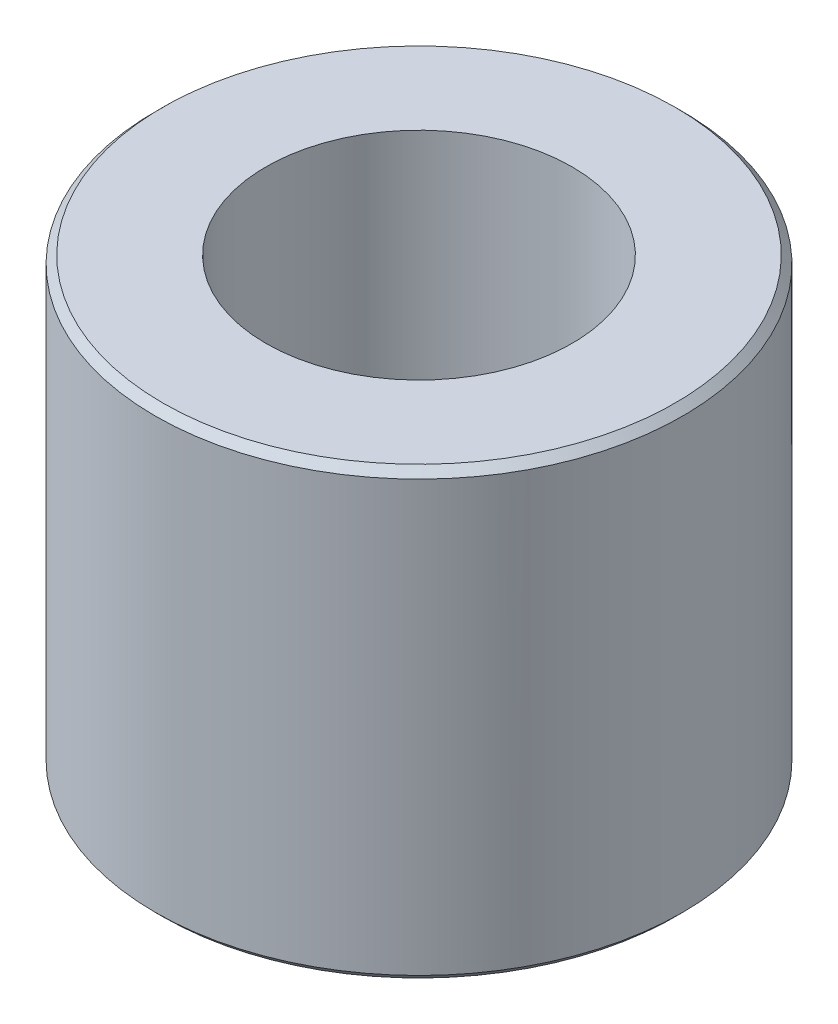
from build123d import *

# Parameters (mm, degrees)
SKETCH1_W                   = 17.78
SKETCH1_H                   = 29.9974
F_7_8_20_TAPPED_HOLE1_D     = 20.6375
F_7_8_20_TAPPED_HOLE1_DEPTH = 53.5178
F_7_8_20_TAPPED_HOLE1_TIP   = 6.200130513
CHAMFER1_SIZE               = 1.651
CUT_EXTRUDE1_DEPTH          = 12.7
CHAMFER2_SIZE               = 0.508


with BuildPart() as part:
    # Sketch1 → Revolve1 (revolve)
    with BuildSketch(Plane.XY, mode=Mode.PRIVATE) as revolve1_sk:
        with Locations((-8.89, -14.9987)):
            Rectangle(SKETCH1_W, SKETCH1_H)
    revolve(revolve1_sk.sketch.rotate(Axis((0, 12.490214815, 0), (0, -1, 0)), 270), axis=Axis((0, 12.490214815, 0), (0, -1, 0)))

    # 7_8-20 Tapped Hole1
    with Locations(Plane(origin=(0, 0, 0), x_dir=(1, 0, 0), z_dir=(0, 1, 0))):
        with Locations((0, 0)):
            Hole(F_7_8_20_TAPPED_HOLE1_D / 2, depth=F_7_8_20_TAPPED_HOLE1_DEPTH)
            with Locations((0, 0, -(F_7_8_20_TAPPED_HOLE1_DEPTH + F_7_8_20_TAPPED_HOLE1_TIP / 2))):  # 118° drill point
                Cone(0, F_7_8_20_TAPPED_HOLE1_D / 2, F_7_8_20_TAPPED_HOLE1_TIP, mode=Mode.SUBTRACT)

    # Sketch4 → Cut-Revolve1 (revolve, cut)
    with BuildSketch(Plane.XY, mode=Mode.PRIVATE) as cut_revolve1_sk:
        Polygon((-11.1125, -29.9974), (-11.1125, -16.0274), (0, -9.350336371), (0, -29.9974), align=None)
    revolve(cut_revolve1_sk.sketch.rotate(Axis((0, 4.863579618, 0), (0, -1, 0)), 270), axis=Axis((0, 4.863579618, 0), (0, -1, 0)), mode=Mode.SUBTRACT)

    # Chamfer1
    chamfer1_edges = [part.edges().sort_by_distance(p)[0] for p in [
        (0, -29.9974, -11.1125),
    ]]
    chamfer(chamfer1_edges, length=CHAMFER1_SIZE)

    # Sketch5 → Cut-Extrude1 (cut)
    with BuildSketch(Plane.XZ.offset(29.9974)):
        Polygon((12.831609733, 0), (6.415804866, 11.1125), (-6.415804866, 11.1125), (-12.831609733, 0), (-6.415804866, -11.1125), (6.415804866, -11.1125), align=None)
    extrude(amount=-CUT_EXTRUDE1_DEPTH, mode=Mode.SUBTRACT)

    # Chamfer2
    chamfer2_edges = [part.edges().sort_by_distance(p)[0] for p in [
        (0, 0, -17.78),
        (0, -29.9974, -17.78),
    ]]
    chamfer(chamfer2_edges, length=CHAMFER2_SIZE)


solid = part.part
